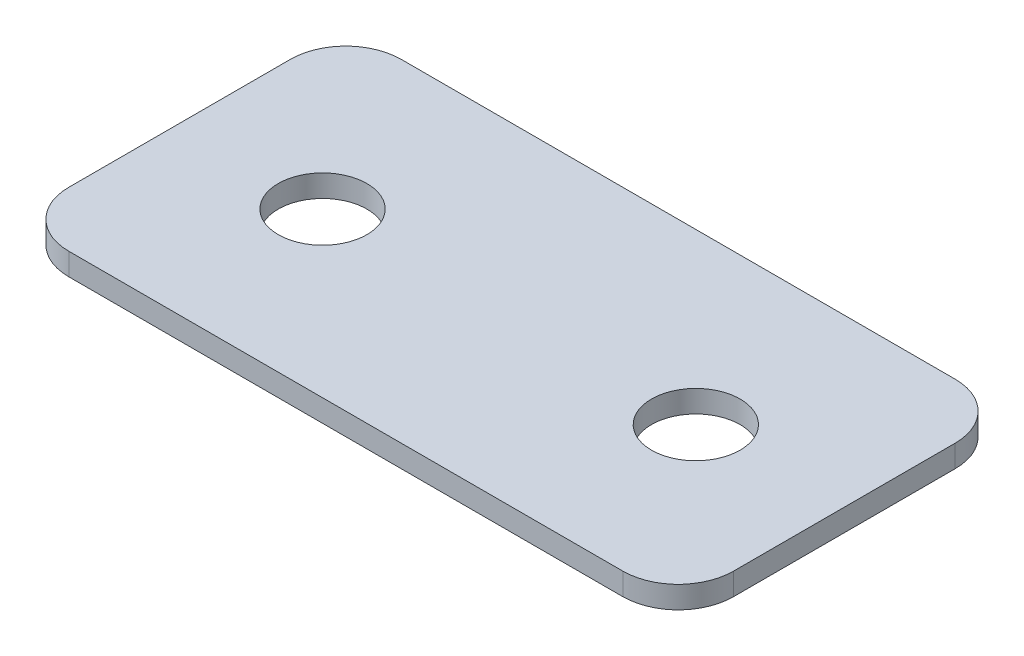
ISO-10303-21;
HEADER;
FILE_DESCRIPTION(('STEP AP214'),'2;1');
FILE_NAME('part.step','',(''),(''),'','','');
FILE_SCHEMA(('AUTOMOTIVE_DESIGN { 1 0 10303 214 1 1 1 1 }'));
ENDSEC;
DATA;
#1=APPLICATION_CONTEXT('core data for automotive mechanical design processes');
#2=APPLICATION_PROTOCOL_DEFINITION('international standard','automotive_design',2000,#1);
#3=PRODUCT_CONTEXT('',#1,'mechanical');
#4=PRODUCT('Part','Part','',(#3));
#5=PRODUCT_RELATED_PRODUCT_CATEGORY('part','',(#4));
#6=PRODUCT_DEFINITION_FORMATION('','',#4);
#7=PRODUCT_DEFINITION_CONTEXT('part definition',#1,'design');
#8=PRODUCT_DEFINITION('design','',#6,#7);
#9=PRODUCT_DEFINITION_SHAPE('','',#8);
#10=(LENGTH_UNIT() NAMED_UNIT(*) SI_UNIT(.MILLI.,.METRE.));
#11=(NAMED_UNIT(*) PLANE_ANGLE_UNIT() SI_UNIT($,.RADIAN.));
#12=(NAMED_UNIT(*) SI_UNIT($,.STERADIAN.) SOLID_ANGLE_UNIT());
#13=UNCERTAINTY_MEASURE_WITH_UNIT(LENGTH_MEASURE(1.E-05),#10,'distance_accuracy_value','');
#14=(GEOMETRIC_REPRESENTATION_CONTEXT(3) GLOBAL_UNCERTAINTY_ASSIGNED_CONTEXT((#13)) GLOBAL_UNIT_ASSIGNED_CONTEXT((#10,
#11,#12)) REPRESENTATION_CONTEXT('',''));
#15=CARTESIAN_POINT('',(0.,0.,0.));
#16=DIRECTION('',(0.,0.,1.));
#17=DIRECTION('',(1.,0.,0.));
#18=AXIS2_PLACEMENT_3D('',#15,#16,#17);
#19=CARTESIAN_POINT('',(19.9718751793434,3.,23.1954761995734));
#20=DIRECTION('',(0.,1.,0.));
#21=DIRECTION('',(0.,0.,1.));
#22=AXIS2_PLACEMENT_3D('',#19,#20,#21);
#23=CYLINDRICAL_SURFACE('',#22,4.);
#24=CARTESIAN_POINT('',(19.9718751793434,3.,23.1954761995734));
#25=DIRECTION('',(0.,1.,0.));
#26=DIRECTION('',(0.,0.,1.));
#27=AXIS2_PLACEMENT_3D('',#24,#25,#26);
#28=CIRCLE('',#27,4.);
#29=CARTESIAN_POINT('',(19.9718751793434,3.,27.1954761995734));
#30=VERTEX_POINT('',#29);
#31=EDGE_CURVE('E177',#30,#30,#28,.T.);
#32=ORIENTED_EDGE('',*,*,#31,.F.);
#33=EDGE_LOOP('',(#32));
#34=FACE_BOUND('',#33,.T.);
#35=CARTESIAN_POINT('',(19.9718751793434,5.,23.1954761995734));
#36=DIRECTION('',(0.,1.,0.));
#37=DIRECTION('',(0.,0.,1.));
#38=AXIS2_PLACEMENT_3D('',#35,#36,#37);
#39=CIRCLE('',#38,4.);
#40=CARTESIAN_POINT('',(19.9718751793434,5.,27.1954761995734));
#41=VERTEX_POINT('',#40);
#42=EDGE_CURVE('E227',#41,#41,#39,.F.);
#43=ORIENTED_EDGE('',*,*,#42,.F.);
#44=EDGE_LOOP('',(#43));
#45=FACE_BOUND('',#44,.T.);
#46=ADVANCED_FACE('F93',(#34,#45),#23,.F.);
#47=CARTESIAN_POINT('',(-13.7158899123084,3.,23.1954761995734));
#48=DIRECTION('',(0.,1.,0.));
#49=DIRECTION('',(0.,0.,1.));
#50=AXIS2_PLACEMENT_3D('',#47,#48,#49);
#51=CYLINDRICAL_SURFACE('',#50,4.);
#52=CARTESIAN_POINT('',(-13.7158899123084,3.,23.1954761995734));
#53=DIRECTION('',(0.,1.,0.));
#54=DIRECTION('',(0.,0.,1.));
#55=AXIS2_PLACEMENT_3D('',#52,#53,#54);
#56=CIRCLE('',#55,4.);
#57=CARTESIAN_POINT('',(-13.7158899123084,3.,27.1954761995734));
#58=VERTEX_POINT('',#57);
#59=EDGE_CURVE('E181',#58,#58,#56,.T.);
#60=ORIENTED_EDGE('',*,*,#59,.F.);
#61=EDGE_LOOP('',(#60));
#62=FACE_BOUND('',#61,.T.);
#63=CARTESIAN_POINT('',(-13.7158899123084,5.,23.1954761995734));
#64=DIRECTION('',(0.,1.,0.));
#65=DIRECTION('',(0.,0.,1.));
#66=AXIS2_PLACEMENT_3D('',#63,#64,#65);
#67=CIRCLE('',#66,4.);
#68=CARTESIAN_POINT('',(-13.7158899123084,5.,27.1954761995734));
#69=VERTEX_POINT('',#68);
#70=EDGE_CURVE('E169',#69,#69,#67,.F.);
#71=ORIENTED_EDGE('',*,*,#70,.F.);
#72=EDGE_LOOP('',(#71));
#73=FACE_BOUND('',#72,.T.);
#74=ADVANCED_FACE('F267',(#62,#73),#51,.F.);
#75=CARTESIAN_POINT('',(0.,0.,7.9419889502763));
#76=DIRECTION('',(0.,0.,-1.));
#77=DIRECTION('',(-1.,0.,0.));
#78=AXIS2_PLACEMENT_3D('',#75,#76,#77);
#79=PLANE('',#78);
#80=DIRECTION('',(0.,1.,0.));
#81=VECTOR('',#80,1.);
#82=CARTESIAN_POINT('',(-21.8720073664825,0.,7.94198895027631));
#83=LINE('',#82,#81);
#84=CARTESIAN_POINT('',(-21.8720073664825,3.,7.94198895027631));
#85=VERTEX_POINT('',#84);
#86=CARTESIAN_POINT('',(-21.8720073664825,5.,7.94198895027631));
#87=VERTEX_POINT('',#86);
#88=EDGE_CURVE('E168',#85,#87,#83,.T.);
#89=ORIENTED_EDGE('',*,*,#88,.T.);
#90=DIRECTION('',(1.,0.,0.));
#91=VECTOR('',#90,1.);
#92=CARTESIAN_POINT('',(0.,5.,7.9419889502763));
#93=LINE('',#92,#91);
#94=CARTESIAN_POINT('',(28.1279926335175,5.,7.9419889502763));
#95=VERTEX_POINT('',#94);
#96=EDGE_CURVE('E156',#87,#95,#93,.T.);
#97=ORIENTED_EDGE('',*,*,#96,.T.);
#98=DIRECTION('',(0.,1.,0.));
#99=VECTOR('',#98,1.);
#100=CARTESIAN_POINT('',(28.1279926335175,0.,7.9419889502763));
#101=LINE('',#100,#99);
#102=CARTESIAN_POINT('',(28.1279926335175,3.,7.9419889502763));
#103=VERTEX_POINT('',#102);
#104=EDGE_CURVE('E166',#103,#95,#101,.T.);
#105=ORIENTED_EDGE('',*,*,#104,.F.);
#106=DIRECTION('',(1.,0.,0.));
#107=VECTOR('',#106,1.);
#108=CARTESIAN_POINT('',(0.,3.,7.9419889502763));
#109=LINE('',#108,#107);
#110=EDGE_CURVE('E114',#85,#103,#109,.T.);
#111=ORIENTED_EDGE('',*,*,#110,.F.);
#112=EDGE_LOOP('',(#89,#97,#105,#111));
#113=FACE_BOUND('',#112,.T.);
#114=ADVANCED_FACE('F165',(#113),#79,.T.);
#115=CARTESIAN_POINT('',(-21.8720073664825,0.,12.9419889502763));
#116=DIRECTION('',(0.,1.,0.));
#117=DIRECTION('',(0.,0.,1.));
#118=AXIS2_PLACEMENT_3D('',#115,#116,#117);
#119=CYLINDRICAL_SURFACE('',#118,5.);
#120=CARTESIAN_POINT('',(-21.8720073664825,5.,12.9419889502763));
#121=DIRECTION('',(0.,1.,0.));
#122=DIRECTION('',(0.,0.,1.));
#123=AXIS2_PLACEMENT_3D('',#120,#121,#122);
#124=CIRCLE('',#123,5.);
#125=CARTESIAN_POINT('',(-26.8720073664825,5.,12.9419889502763));
#126=VERTEX_POINT('',#125);
#127=EDGE_CURVE('E170',#87,#126,#124,.T.);
#128=ORIENTED_EDGE('',*,*,#127,.F.);
#129=ORIENTED_EDGE('',*,*,#88,.F.);
#130=CARTESIAN_POINT('',(-21.8720073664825,3.,12.9419889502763));
#131=DIRECTION('',(0.,1.,0.));
#132=DIRECTION('',(0.,0.,1.));
#133=AXIS2_PLACEMENT_3D('',#130,#131,#132);
#134=CIRCLE('',#133,5.);
#135=CARTESIAN_POINT('',(-26.8720073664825,3.,12.9419889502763));
#136=VERTEX_POINT('',#135);
#137=EDGE_CURVE('E240',#85,#136,#134,.T.);
#138=ORIENTED_EDGE('',*,*,#137,.T.);
#139=DIRECTION('',(0.,1.,0.));
#140=VECTOR('',#139,1.);
#141=CARTESIAN_POINT('',(-26.8720073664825,0.,12.9419889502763));
#142=LINE('',#141,#140);
#143=EDGE_CURVE('E185',#136,#126,#142,.T.);
#144=ORIENTED_EDGE('',*,*,#143,.T.);
#145=EDGE_LOOP('',(#128,#129,#138,#144));
#146=FACE_BOUND('',#145,.T.);
#147=ADVANCED_FACE('F241',(#146),#119,.T.);
#148=CARTESIAN_POINT('',(-26.8720073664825,0.,0.));
#149=DIRECTION('',(1.,0.,0.));
#150=DIRECTION('',(0.,0.,-1.));
#151=AXIS2_PLACEMENT_3D('',#148,#149,#150);
#152=PLANE('',#151);
#153=DIRECTION('',(0.,0.,1.));
#154=VECTOR('',#153,1.);
#155=CARTESIAN_POINT('',(-26.8720073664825,5.,0.));
#156=LINE('',#155,#154);
#157=CARTESIAN_POINT('',(-26.8720073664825,5.,32.9419889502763));
#158=VERTEX_POINT('',#157);
#159=EDGE_CURVE('E222',#126,#158,#156,.T.);
#160=ORIENTED_EDGE('',*,*,#159,.F.);
#161=ORIENTED_EDGE('',*,*,#143,.F.);
#162=DIRECTION('',(0.,0.,1.));
#163=VECTOR('',#162,1.);
#164=CARTESIAN_POINT('',(-26.8720073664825,3.,0.));
#165=LINE('',#164,#163);
#166=CARTESIAN_POINT('',(-26.8720073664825,3.,32.9419889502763));
#167=VERTEX_POINT('',#166);
#168=EDGE_CURVE('E238',#136,#167,#165,.T.);
#169=ORIENTED_EDGE('',*,*,#168,.T.);
#170=DIRECTION('',(0.,1.,0.));
#171=VECTOR('',#170,1.);
#172=CARTESIAN_POINT('',(-26.8720073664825,0.,32.9419889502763));
#173=LINE('',#172,#171);
#174=EDGE_CURVE('E188',#167,#158,#173,.T.);
#175=ORIENTED_EDGE('',*,*,#174,.T.);
#176=EDGE_LOOP('',(#160,#161,#169,#175));
#177=FACE_BOUND('',#176,.T.);
#178=ADVANCED_FACE('F244',(#177),#152,.F.);
#179=CARTESIAN_POINT('',(-21.8720073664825,0.,32.9419889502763));
#180=DIRECTION('',(0.,1.,0.));
#181=DIRECTION('',(0.,0.,1.));
#182=AXIS2_PLACEMENT_3D('',#179,#180,#181);
#183=CYLINDRICAL_SURFACE('',#182,5.);
#184=CARTESIAN_POINT('',(-21.8720073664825,5.,32.9419889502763));
#185=DIRECTION('',(0.,1.,0.));
#186=DIRECTION('',(0.,0.,1.));
#187=AXIS2_PLACEMENT_3D('',#184,#185,#186);
#188=CIRCLE('',#187,5.);
#189=CARTESIAN_POINT('',(-21.8720073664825,5.,37.9419889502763));
#190=VERTEX_POINT('',#189);
#191=EDGE_CURVE('E220',#158,#190,#188,.T.);
#192=ORIENTED_EDGE('',*,*,#191,.F.);
#193=ORIENTED_EDGE('',*,*,#174,.F.);
#194=CARTESIAN_POINT('',(-21.8720073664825,3.,32.9419889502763));
#195=DIRECTION('',(0.,1.,0.));
#196=DIRECTION('',(0.,0.,1.));
#197=AXIS2_PLACEMENT_3D('',#194,#195,#196);
#198=CIRCLE('',#197,5.);
#199=CARTESIAN_POINT('',(-21.8720073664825,3.,37.9419889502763));
#200=VERTEX_POINT('',#199);
#201=EDGE_CURVE('E235',#167,#200,#198,.T.);
#202=ORIENTED_EDGE('',*,*,#201,.T.);
#203=DIRECTION('',(0.,1.,0.));
#204=VECTOR('',#203,1.);
#205=CARTESIAN_POINT('',(-21.8720073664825,0.,37.9419889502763));
#206=LINE('',#205,#204);
#207=EDGE_CURVE('E194',#200,#190,#206,.T.);
#208=ORIENTED_EDGE('',*,*,#207,.T.);
#209=EDGE_LOOP('',(#192,#193,#202,#208));
#210=FACE_BOUND('',#209,.T.);
#211=ADVANCED_FACE('F249',(#210),#183,.T.);
#212=CARTESIAN_POINT('',(0.,0.,37.9419889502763));
#213=DIRECTION('',(0.,0.,-1.));
#214=DIRECTION('',(-1.,0.,0.));
#215=AXIS2_PLACEMENT_3D('',#212,#213,#214);
#216=PLANE('',#215);
#217=DIRECTION('',(1.,0.,0.));
#218=VECTOR('',#217,1.);
#219=CARTESIAN_POINT('',(0.,5.,37.9419889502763));
#220=LINE('',#219,#218);
#221=CARTESIAN_POINT('',(28.1279926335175,5.,37.9419889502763));
#222=VERTEX_POINT('',#221);
#223=EDGE_CURVE('E216',#190,#222,#220,.T.);
#224=ORIENTED_EDGE('',*,*,#223,.F.);
#225=ORIENTED_EDGE('',*,*,#207,.F.);
#226=DIRECTION('',(1.,0.,0.));
#227=VECTOR('',#226,1.);
#228=CARTESIAN_POINT('',(0.,3.,37.9419889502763));
#229=LINE('',#228,#227);
#230=CARTESIAN_POINT('',(28.1279926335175,3.,37.9419889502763));
#231=VERTEX_POINT('',#230);
#232=EDGE_CURVE('E232',#200,#231,#229,.T.);
#233=ORIENTED_EDGE('',*,*,#232,.T.);
#234=DIRECTION('',(0.,1.,0.));
#235=VECTOR('',#234,1.);
#236=CARTESIAN_POINT('',(28.1279926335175,0.,37.9419889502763));
#237=LINE('',#236,#235);
#238=EDGE_CURVE('E201',#231,#222,#237,.T.);
#239=ORIENTED_EDGE('',*,*,#238,.T.);
#240=EDGE_LOOP('',(#224,#225,#233,#239));
#241=FACE_BOUND('',#240,.T.);
#242=ADVANCED_FACE('F252',(#241),#216,.F.);
#243=CARTESIAN_POINT('',(28.1279926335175,0.,32.9419889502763));
#244=DIRECTION('',(0.,1.,0.));
#245=DIRECTION('',(0.,0.,1.));
#246=AXIS2_PLACEMENT_3D('',#243,#244,#245);
#247=CYLINDRICAL_SURFACE('',#246,5.);
#248=DIRECTION('',(0.,1.,0.));
#249=VECTOR('',#248,1.);
#250=CARTESIAN_POINT('',(33.1279926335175,0.,32.9419889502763));
#251=LINE('',#250,#249);
#252=CARTESIAN_POINT('',(33.1279926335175,3.,32.9419889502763));
#253=VERTEX_POINT('',#252);
#254=CARTESIAN_POINT('',(33.1279926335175,5.,32.9419889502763));
#255=VERTEX_POINT('',#254);
#256=EDGE_CURVE('E175',#253,#255,#251,.T.);
#257=ORIENTED_EDGE('',*,*,#256,.T.);
#258=CARTESIAN_POINT('',(28.1279926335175,5.,32.9419889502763));
#259=DIRECTION('',(0.,1.,0.));
#260=DIRECTION('',(0.,0.,1.));
#261=AXIS2_PLACEMENT_3D('',#258,#259,#260);
#262=CIRCLE('',#261,5.);
#263=EDGE_CURVE('E210',#255,#222,#262,.F.);
#264=ORIENTED_EDGE('',*,*,#263,.T.);
#265=ORIENTED_EDGE('',*,*,#238,.F.);
#266=CARTESIAN_POINT('',(28.1279926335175,3.,32.9419889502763));
#267=DIRECTION('',(0.,1.,0.));
#268=DIRECTION('',(0.,0.,1.));
#269=AXIS2_PLACEMENT_3D('',#266,#267,#268);
#270=CIRCLE('',#269,5.);
#271=EDGE_CURVE('E211',#253,#231,#270,.F.);
#272=ORIENTED_EDGE('',*,*,#271,.F.);
#273=EDGE_LOOP('',(#257,#264,#265,#272));
#274=FACE_BOUND('',#273,.T.);
#275=ADVANCED_FACE('F208',(#274),#247,.T.);
#276=CARTESIAN_POINT('',(33.1279926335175,0.,0.));
#277=DIRECTION('',(1.,0.,0.));
#278=DIRECTION('',(0.,0.,-1.));
#279=AXIS2_PLACEMENT_3D('',#276,#277,#278);
#280=PLANE('',#279);
#281=DIRECTION('',(0.,1.,0.));
#282=VECTOR('',#281,1.);
#283=CARTESIAN_POINT('',(33.1279926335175,0.,12.9419889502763));
#284=LINE('',#283,#282);
#285=CARTESIAN_POINT('',(33.1279926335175,3.,12.9419889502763));
#286=VERTEX_POINT('',#285);
#287=CARTESIAN_POINT('',(33.1279926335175,5.,12.9419889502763));
#288=VERTEX_POINT('',#287);
#289=EDGE_CURVE('E173',#286,#288,#284,.T.);
#290=ORIENTED_EDGE('',*,*,#289,.T.);
#291=DIRECTION('',(0.,0.,1.));
#292=VECTOR('',#291,1.);
#293=CARTESIAN_POINT('',(33.1279926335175,5.,0.));
#294=LINE('',#293,#292);
#295=EDGE_CURVE('E107',#288,#255,#294,.T.);
#296=ORIENTED_EDGE('',*,*,#295,.T.);
#297=ORIENTED_EDGE('',*,*,#256,.F.);
#298=DIRECTION('',(0.,0.,1.));
#299=VECTOR('',#298,1.);
#300=CARTESIAN_POINT('',(33.1279926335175,3.,0.));
#301=LINE('',#300,#299);
#302=EDGE_CURVE('E214',#286,#253,#301,.T.);
#303=ORIENTED_EDGE('',*,*,#302,.F.);
#304=EDGE_LOOP('',(#290,#296,#297,#303));
#305=FACE_BOUND('',#304,.T.);
#306=ADVANCED_FACE('F213',(#305),#280,.T.);
#307=CARTESIAN_POINT('',(28.1279926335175,0.,12.9419889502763));
#308=DIRECTION('',(0.,1.,0.));
#309=DIRECTION('',(0.,0.,1.));
#310=AXIS2_PLACEMENT_3D('',#307,#308,#309);
#311=CYLINDRICAL_SURFACE('',#310,5.);
#312=ORIENTED_EDGE('',*,*,#104,.T.);
#313=CARTESIAN_POINT('',(28.1279926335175,5.,12.9419889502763));
#314=DIRECTION('',(0.,1.,0.));
#315=DIRECTION('',(0.,0.,1.));
#316=AXIS2_PLACEMENT_3D('',#313,#314,#315);
#317=CIRCLE('',#316,5.);
#318=EDGE_CURVE('E12',#95,#288,#317,.F.);
#319=ORIENTED_EDGE('',*,*,#318,.T.);
#320=ORIENTED_EDGE('',*,*,#289,.F.);
#321=CARTESIAN_POINT('',(28.1279926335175,3.,12.9419889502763));
#322=DIRECTION('',(0.,1.,0.));
#323=DIRECTION('',(0.,0.,1.));
#324=AXIS2_PLACEMENT_3D('',#321,#322,#323);
#325=CIRCLE('',#324,5.);
#326=EDGE_CURVE('E100',#103,#286,#325,.F.);
#327=ORIENTED_EDGE('',*,*,#326,.F.);
#328=EDGE_LOOP('',(#312,#319,#320,#327));
#329=FACE_BOUND('',#328,.T.);
#330=ADVANCED_FACE('F172',(#329),#311,.T.);
#331=CARTESIAN_POINT('',(19.9718751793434,3.,23.1954761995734));
#332=DIRECTION('',(0.,1.,0.));
#333=DIRECTION('',(0.,0.,1.));
#334=AXIS2_PLACEMENT_3D('',#331,#332,#333);
#335=PLANE('',#334);
#336=ORIENTED_EDGE('',*,*,#31,.T.);
#337=EDGE_LOOP('',(#336));
#338=FACE_BOUND('',#337,.T.);
#339=ORIENTED_EDGE('',*,*,#59,.T.);
#340=EDGE_LOOP('',(#339));
#341=FACE_BOUND('',#340,.T.);
#342=ORIENTED_EDGE('',*,*,#110,.T.);
#343=ORIENTED_EDGE('',*,*,#326,.T.);
#344=ORIENTED_EDGE('',*,*,#302,.T.);
#345=ORIENTED_EDGE('',*,*,#271,.T.);
#346=ORIENTED_EDGE('',*,*,#232,.F.);
#347=ORIENTED_EDGE('',*,*,#201,.F.);
#348=ORIENTED_EDGE('',*,*,#168,.F.);
#349=ORIENTED_EDGE('',*,*,#137,.F.);
#350=EDGE_LOOP('',(#342,#343,#344,#345,#346,#347,#348,#349));
#351=FACE_BOUND('',#350,.T.);
#352=ADVANCED_FACE('F253',(#338,#341,#351),#335,.F.);
#353=CARTESIAN_POINT('',(0.,5.,0.));
#354=DIRECTION('',(0.,1.,0.));
#355=DIRECTION('',(0.,0.,1.));
#356=AXIS2_PLACEMENT_3D('',#353,#354,#355);
#357=PLANE('',#356);
#358=ORIENTED_EDGE('',*,*,#127,.T.);
#359=ORIENTED_EDGE('',*,*,#159,.T.);
#360=ORIENTED_EDGE('',*,*,#191,.T.);
#361=ORIENTED_EDGE('',*,*,#223,.T.);
#362=ORIENTED_EDGE('',*,*,#263,.F.);
#363=ORIENTED_EDGE('',*,*,#295,.F.);
#364=ORIENTED_EDGE('',*,*,#318,.F.);
#365=ORIENTED_EDGE('',*,*,#96,.F.);
#366=EDGE_LOOP('',(#358,#359,#360,#361,#362,#363,#364,#365));
#367=FACE_BOUND('',#366,.T.);
#368=ORIENTED_EDGE('',*,*,#70,.T.);
#369=EDGE_LOOP('',(#368));
#370=FACE_BOUND('',#369,.T.);
#371=ORIENTED_EDGE('',*,*,#42,.T.);
#372=EDGE_LOOP('',(#371));
#373=FACE_BOUND('',#372,.T.);
#374=ADVANCED_FACE('F154',(#367,#370,#373),#357,.T.);
#375=CLOSED_SHELL('',(#46,#74,#114,#147,#178,#211,#242,#275,#306,#330,#352,#374));
#376=MANIFOLD_SOLID_BREP('B2',#375);
#377=ADVANCED_BREP_SHAPE_REPRESENTATION('',(#18,#376),#14);
#378=SHAPE_DEFINITION_REPRESENTATION(#9,#377);
ENDSEC;
END-ISO-10303-21;
